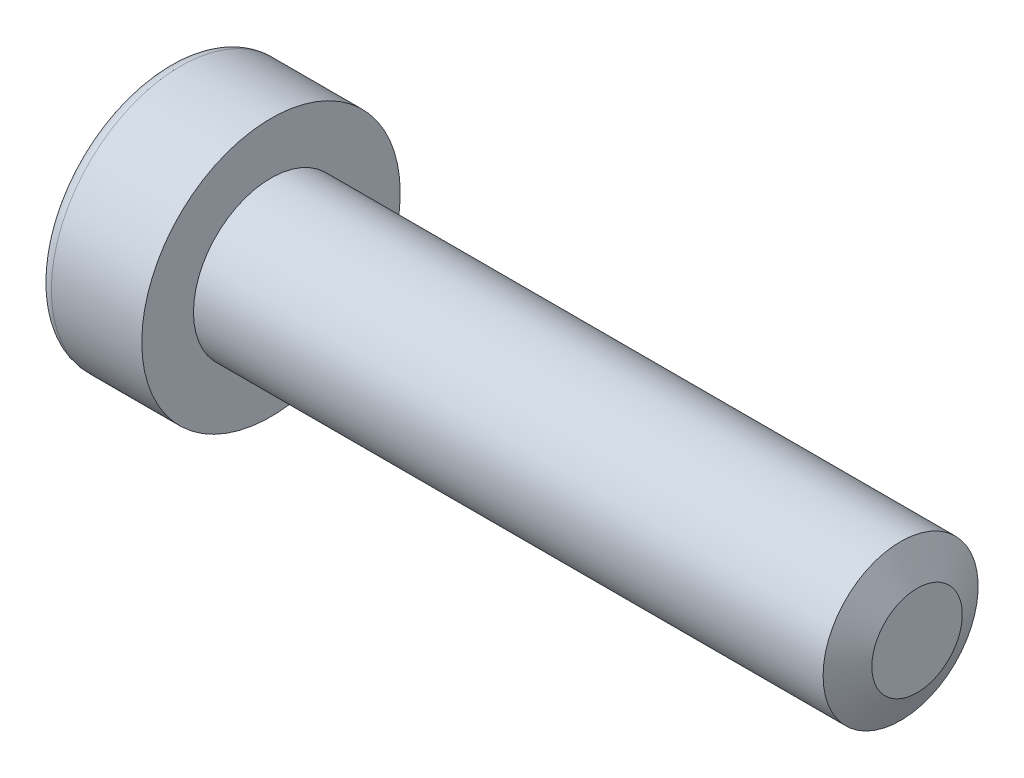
ISO-10303-21;
HEADER;
FILE_DESCRIPTION(('STEP AP214'),'2;1');
FILE_NAME('part.step','',(''),(''),'','','');
FILE_SCHEMA(('AUTOMOTIVE_DESIGN { 1 0 10303 214 1 1 1 1 }'));
ENDSEC;
DATA;
#1=APPLICATION_CONTEXT('core data for automotive mechanical design processes');
#2=APPLICATION_PROTOCOL_DEFINITION('international standard','automotive_design',2000,#1);
#3=PRODUCT_CONTEXT('',#1,'mechanical');
#4=PRODUCT('Part','Part','',(#3));
#5=PRODUCT_RELATED_PRODUCT_CATEGORY('part','',(#4));
#6=PRODUCT_DEFINITION_FORMATION('','',#4);
#7=PRODUCT_DEFINITION_CONTEXT('part definition',#1,'design');
#8=PRODUCT_DEFINITION('design','',#6,#7);
#9=PRODUCT_DEFINITION_SHAPE('','',#8);
#10=(LENGTH_UNIT() NAMED_UNIT(*) SI_UNIT(.MILLI.,.METRE.));
#11=(NAMED_UNIT(*) PLANE_ANGLE_UNIT() SI_UNIT($,.RADIAN.));
#12=(NAMED_UNIT(*) SI_UNIT($,.STERADIAN.) SOLID_ANGLE_UNIT());
#13=UNCERTAINTY_MEASURE_WITH_UNIT(LENGTH_MEASURE(1.E-05),#10,'distance_accuracy_value','');
#14=(GEOMETRIC_REPRESENTATION_CONTEXT(3) GLOBAL_UNCERTAINTY_ASSIGNED_CONTEXT((#13)) GLOBAL_UNIT_ASSIGNED_CONTEXT((#10,
#11,#12)) REPRESENTATION_CONTEXT('',''));
#15=CARTESIAN_POINT('',(0.,0.,0.));
#16=DIRECTION('',(0.,0.,1.));
#17=DIRECTION('',(1.,0.,0.));
#18=AXIS2_PLACEMENT_3D('',#15,#16,#17);
#19=CARTESIAN_POINT('',(-25.,5.,0.));
#20=DIRECTION('',(-1.,0.,0.));
#21=DIRECTION('',(0.,0.,1.));
#22=AXIS2_PLACEMENT_3D('',#19,#20,#21);
#23=PLANE('',#22);
#24=CARTESIAN_POINT('',(-25.,0.,0.));
#25=DIRECTION('',(-1.,0.,0.));
#26=DIRECTION('',(0.,0.,1.));
#27=AXIS2_PLACEMENT_3D('',#24,#25,#26);
#28=CIRCLE('',#27,5.);
#29=CARTESIAN_POINT('',(-25.,0.,5.));
#30=VERTEX_POINT('',#29);
#31=EDGE_CURVE('E147',#30,#30,#28,.T.);
#32=ORIENTED_EDGE('',*,*,#31,.F.);
#33=EDGE_LOOP('',(#32));
#34=FACE_BOUND('',#33,.T.);
#35=CARTESIAN_POINT('',(-25.,0.,0.));
#36=DIRECTION('',(-1.,0.,0.));
#37=DIRECTION('',(0.,0.,1.));
#38=AXIS2_PLACEMENT_3D('',#35,#36,#37);
#39=CIRCLE('',#38,3.);
#40=CARTESIAN_POINT('',(-25.,0.,3.));
#41=VERTEX_POINT('',#40);
#42=EDGE_CURVE('E139',#41,#41,#39,.T.);
#43=ORIENTED_EDGE('',*,*,#42,.T.);
#44=EDGE_LOOP('',(#43));
#45=FACE_BOUND('',#44,.T.);
#46=ADVANCED_FACE('F37',(#34,#45),#23,.F.);
#47=CARTESIAN_POINT('',(-65.0118083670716,0.,0.));
#48=DIRECTION('',(-1.,0.,0.));
#49=DIRECTION('',(0.,0.,1.));
#50=AXIS2_PLACEMENT_3D('',#47,#48,#49);
#51=CYLINDRICAL_SURFACE('',#50,5.);
#52=CARTESIAN_POINT('',(-28.5,0.,0.));
#53=DIRECTION('',(1.,0.,0.));
#54=DIRECTION('',(0.,0.,-1.));
#55=AXIS2_PLACEMENT_3D('',#52,#53,#54);
#56=CIRCLE('',#55,5.);
#57=CARTESIAN_POINT('',(-28.5,0.,-5.));
#58=VERTEX_POINT('',#57);
#59=EDGE_CURVE('E153',#58,#58,#56,.T.);
#60=ORIENTED_EDGE('',*,*,#59,.T.);
#61=EDGE_LOOP('',(#60));
#62=FACE_BOUND('',#61,.T.);
#63=ORIENTED_EDGE('',*,*,#31,.T.);
#64=EDGE_LOOP('',(#63));
#65=FACE_BOUND('',#64,.T.);
#66=ADVANCED_FACE('F170',(#62,#65),#51,.T.);
#67=CARTESIAN_POINT('',(-29.,0.,0.));
#68=DIRECTION('',(1.,0.,0.));
#69=DIRECTION('',(0.,0.,-1.));
#70=AXIS2_PLACEMENT_3D('',#67,#68,#69);
#71=PLANE('',#70);
#72=DIRECTION('',(0.,0.5,-0.866025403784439));
#73=VECTOR('',#72,1.);
#74=CARTESIAN_POINT('',(-29.,1.15470053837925,2.));
#75=LINE('',#74,#73);
#76=CARTESIAN_POINT('',(-29.,1.15470053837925,2.));
#77=VERTEX_POINT('',#76);
#78=CARTESIAN_POINT('',(-29.,2.3094010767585,0.));
#79=VERTEX_POINT('',#78);
#80=EDGE_CURVE('E126',#77,#79,#75,.T.);
#81=ORIENTED_EDGE('',*,*,#80,.F.);
#82=DIRECTION('',(0.,1.,0.));
#83=VECTOR('',#82,1.);
#84=CARTESIAN_POINT('',(-29.,-1.15470053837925,2.));
#85=LINE('',#84,#83);
#86=CARTESIAN_POINT('',(-29.,-1.15470053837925,2.));
#87=VERTEX_POINT('',#86);
#88=EDGE_CURVE('E52',#87,#77,#85,.T.);
#89=ORIENTED_EDGE('',*,*,#88,.F.);
#90=DIRECTION('',(0.,0.5,0.866025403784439));
#91=VECTOR('',#90,1.);
#92=CARTESIAN_POINT('',(-29.,-2.3094010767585,0.));
#93=LINE('',#92,#91);
#94=CARTESIAN_POINT('',(-29.,-2.3094010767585,0.));
#95=VERTEX_POINT('',#94);
#96=EDGE_CURVE('E135',#95,#87,#93,.T.);
#97=ORIENTED_EDGE('',*,*,#96,.F.);
#98=DIRECTION('',(0.,-0.5,0.866025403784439));
#99=VECTOR('',#98,1.);
#100=CARTESIAN_POINT('',(-29.,-1.15470053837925,-2.));
#101=LINE('',#100,#99);
#102=CARTESIAN_POINT('',(-29.,-1.15470053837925,-2.));
#103=VERTEX_POINT('',#102);
#104=EDGE_CURVE('E133',#103,#95,#101,.T.);
#105=ORIENTED_EDGE('',*,*,#104,.F.);
#106=DIRECTION('',(0.,-1.,0.));
#107=VECTOR('',#106,1.);
#108=CARTESIAN_POINT('',(-29.,1.15470053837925,-2.));
#109=LINE('',#108,#107);
#110=CARTESIAN_POINT('',(-29.,1.15470053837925,-2.));
#111=VERTEX_POINT('',#110);
#112=EDGE_CURVE('E100',#111,#103,#109,.T.);
#113=ORIENTED_EDGE('',*,*,#112,.F.);
#114=DIRECTION('',(0.,-0.5,-0.866025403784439));
#115=VECTOR('',#114,1.);
#116=CARTESIAN_POINT('',(-29.,2.3094010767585,0.));
#117=LINE('',#116,#115);
#118=EDGE_CURVE('E129',#79,#111,#117,.T.);
#119=ORIENTED_EDGE('',*,*,#118,.F.);
#120=EDGE_LOOP('',(#81,#89,#97,#105,#113,#119));
#121=FACE_BOUND('',#120,.T.);
#122=CARTESIAN_POINT('',(-29.,0.,0.));
#123=DIRECTION('',(1.,0.,0.));
#124=DIRECTION('',(0.,0.,-1.));
#125=AXIS2_PLACEMENT_3D('',#122,#123,#124);
#126=CIRCLE('',#125,4.5);
#127=CARTESIAN_POINT('',(-29.,0.,-4.5));
#128=VERTEX_POINT('',#127);
#129=EDGE_CURVE('E150',#128,#128,#126,.F.);
#130=ORIENTED_EDGE('',*,*,#129,.T.);
#131=EDGE_LOOP('',(#130));
#132=FACE_BOUND('',#131,.T.);
#133=ADVANCED_FACE('F176',(#121,#132),#71,.F.);
#134=CARTESIAN_POINT('',(0.,3.,0.));
#135=DIRECTION('',(-1.,0.,0.));
#136=DIRECTION('',(0.,0.,1.));
#137=AXIS2_PLACEMENT_3D('',#134,#135,#136);
#138=PLANE('',#137);
#139=CARTESIAN_POINT('',(0.,0.,0.));
#140=DIRECTION('',(-1.,0.,0.));
#141=DIRECTION('',(0.,0.,1.));
#142=AXIS2_PLACEMENT_3D('',#139,#140,#141);
#143=CIRCLE('',#142,1.74999999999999);
#144=CARTESIAN_POINT('',(0.,0.,1.74999999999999));
#145=VERTEX_POINT('',#144);
#146=EDGE_CURVE('E11',#145,#145,#143,.F.);
#147=ORIENTED_EDGE('',*,*,#146,.T.);
#148=EDGE_LOOP('',(#147));
#149=FACE_BOUND('',#148,.T.);
#150=ADVANCED_FACE('F192',(#149),#138,.F.);
#151=CARTESIAN_POINT('',(-65.0118083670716,0.,0.));
#152=DIRECTION('',(-1.,0.,0.));
#153=DIRECTION('',(0.,0.,1.));
#154=AXIS2_PLACEMENT_3D('',#151,#152,#153);
#155=CYLINDRICAL_SURFACE('',#154,3.);
#156=CARTESIAN_POINT('',(-0.636906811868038,0.,0.));
#157=DIRECTION('',(-1.,0.,0.));
#158=DIRECTION('',(0.,0.,1.));
#159=AXIS2_PLACEMENT_3D('',#156,#157,#158);
#160=CIRCLE('',#159,3.);
#161=CARTESIAN_POINT('',(-0.636906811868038,0.,3.));
#162=VERTEX_POINT('',#161);
#163=EDGE_CURVE('E45',#162,#162,#160,.T.);
#164=ORIENTED_EDGE('',*,*,#163,.T.);
#165=EDGE_LOOP('',(#164));
#166=FACE_BOUND('',#165,.T.);
#167=ORIENTED_EDGE('',*,*,#42,.F.);
#168=EDGE_LOOP('',(#167));
#169=FACE_BOUND('',#168,.T.);
#170=ADVANCED_FACE('F158',(#166,#169),#155,.T.);
#171=CARTESIAN_POINT('',(-28.5,0.,0.));
#172=DIRECTION('',(1.,0.,0.));
#173=DIRECTION('',(0.,0.,-1.));
#174=AXIS2_PLACEMENT_3D('',#171,#172,#173);
#175=TOROIDAL_SURFACE('',#174,4.5,0.5);
#176=ORIENTED_EDGE('',*,*,#59,.F.);
#177=EDGE_LOOP('',(#176));
#178=FACE_BOUND('',#177,.T.);
#179=ORIENTED_EDGE('',*,*,#129,.F.);
#180=EDGE_LOOP('',(#179));
#181=FACE_BOUND('',#180,.T.);
#182=ADVANCED_FACE('F182',(#178,#181),#175,.T.);
#183=CARTESIAN_POINT('',(-26.,-1.15470053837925,2.));
#184=DIRECTION('',(0.,0.,1.));
#185=DIRECTION('',(1.,0.,0.));
#186=AXIS2_PLACEMENT_3D('',#183,#184,#185);
#187=PLANE('',#186);
#188=ORIENTED_EDGE('',*,*,#88,.T.);
#189=DIRECTION('',(-1.,0.,0.));
#190=VECTOR('',#189,1.);
#191=CARTESIAN_POINT('',(-26.,1.15470053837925,2.));
#192=LINE('',#191,#190);
#193=CARTESIAN_POINT('',(-26.,1.15470053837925,2.));
#194=VERTEX_POINT('',#193);
#195=EDGE_CURVE('E82',#194,#77,#192,.T.);
#196=ORIENTED_EDGE('',*,*,#195,.F.);
#197=DIRECTION('',(0.,1.,0.));
#198=VECTOR('',#197,1.);
#199=CARTESIAN_POINT('',(-26.,-1.15470053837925,2.));
#200=LINE('',#199,#198);
#201=CARTESIAN_POINT('',(-26.,-1.15470053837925,2.));
#202=VERTEX_POINT('',#201);
#203=EDGE_CURVE('E137',#202,#194,#200,.T.);
#204=ORIENTED_EDGE('',*,*,#203,.F.);
#205=DIRECTION('',(-1.,0.,0.));
#206=VECTOR('',#205,1.);
#207=CARTESIAN_POINT('',(-26.,-1.15470053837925,2.));
#208=LINE('',#207,#206);
#209=EDGE_CURVE('E60',#202,#87,#208,.T.);
#210=ORIENTED_EDGE('',*,*,#209,.T.);
#211=EDGE_LOOP('',(#188,#196,#204,#210));
#212=FACE_BOUND('',#211,.T.);
#213=ADVANCED_FACE('F184',(#212),#187,.F.);
#214=CARTESIAN_POINT('',(-26.,-2.3094010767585,0.));
#215=DIRECTION('',(0.,-0.866025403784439,0.5));
#216=DIRECTION('',(0.,-0.5,-0.866025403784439));
#217=AXIS2_PLACEMENT_3D('',#214,#215,#216);
#218=PLANE('',#217);
#219=ORIENTED_EDGE('',*,*,#96,.T.);
#220=ORIENTED_EDGE('',*,*,#209,.F.);
#221=DIRECTION('',(0.,0.5,0.866025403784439));
#222=VECTOR('',#221,1.);
#223=CARTESIAN_POINT('',(-26.,-2.3094010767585,0.));
#224=LINE('',#223,#222);
#225=CARTESIAN_POINT('',(-26.,-2.3094010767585,0.));
#226=VERTEX_POINT('',#225);
#227=EDGE_CURVE('E112',#226,#202,#224,.T.);
#228=ORIENTED_EDGE('',*,*,#227,.F.);
#229=DIRECTION('',(-1.,0.,0.));
#230=VECTOR('',#229,1.);
#231=CARTESIAN_POINT('',(-26.,-2.3094010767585,0.));
#232=LINE('',#231,#230);
#233=EDGE_CURVE('E104',#226,#95,#232,.T.);
#234=ORIENTED_EDGE('',*,*,#233,.T.);
#235=EDGE_LOOP('',(#219,#220,#228,#234));
#236=FACE_BOUND('',#235,.T.);
#237=ADVANCED_FACE('F190',(#236),#218,.F.);
#238=CARTESIAN_POINT('',(-26.,-1.15470053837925,-2.));
#239=DIRECTION('',(0.,-0.866025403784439,-0.5));
#240=DIRECTION('',(0.,0.5,-0.866025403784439));
#241=AXIS2_PLACEMENT_3D('',#238,#239,#240);
#242=PLANE('',#241);
#243=ORIENTED_EDGE('',*,*,#104,.T.);
#244=ORIENTED_EDGE('',*,*,#233,.F.);
#245=DIRECTION('',(0.,-0.5,0.866025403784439));
#246=VECTOR('',#245,1.);
#247=CARTESIAN_POINT('',(-26.,-1.15470053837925,-2.));
#248=LINE('',#247,#246);
#249=CARTESIAN_POINT('',(-26.,-1.15470053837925,-2.));
#250=VERTEX_POINT('',#249);
#251=EDGE_CURVE('E108',#250,#226,#248,.T.);
#252=ORIENTED_EDGE('',*,*,#251,.F.);
#253=DIRECTION('',(-1.,0.,0.));
#254=VECTOR('',#253,1.);
#255=CARTESIAN_POINT('',(-26.,-1.15470053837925,-2.));
#256=LINE('',#255,#254);
#257=EDGE_CURVE('E93',#250,#103,#256,.T.);
#258=ORIENTED_EDGE('',*,*,#257,.T.);
#259=EDGE_LOOP('',(#243,#244,#252,#258));
#260=FACE_BOUND('',#259,.T.);
#261=ADVANCED_FACE('F109',(#260),#242,.F.);
#262=CARTESIAN_POINT('',(-26.,1.15470053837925,-2.));
#263=DIRECTION('',(0.,0.,-1.));
#264=DIRECTION('',(-1.,0.,0.));
#265=AXIS2_PLACEMENT_3D('',#262,#263,#264);
#266=PLANE('',#265);
#267=ORIENTED_EDGE('',*,*,#112,.T.);
#268=ORIENTED_EDGE('',*,*,#257,.F.);
#269=DIRECTION('',(0.,-1.,0.));
#270=VECTOR('',#269,1.);
#271=CARTESIAN_POINT('',(-26.,1.15470053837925,-2.));
#272=LINE('',#271,#270);
#273=CARTESIAN_POINT('',(-26.,1.15470053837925,-2.));
#274=VERTEX_POINT('',#273);
#275=EDGE_CURVE('E97',#274,#250,#272,.T.);
#276=ORIENTED_EDGE('',*,*,#275,.F.);
#277=DIRECTION('',(-1.,0.,0.));
#278=VECTOR('',#277,1.);
#279=CARTESIAN_POINT('',(-26.,1.15470053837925,-2.));
#280=LINE('',#279,#278);
#281=EDGE_CURVE('E105',#274,#111,#280,.T.);
#282=ORIENTED_EDGE('',*,*,#281,.T.);
#283=EDGE_LOOP('',(#267,#268,#276,#282));
#284=FACE_BOUND('',#283,.T.);
#285=ADVANCED_FACE('F95',(#284),#266,.F.);
#286=CARTESIAN_POINT('',(-26.,2.3094010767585,0.));
#287=DIRECTION('',(0.,0.866025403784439,-0.5));
#288=DIRECTION('',(0.,0.5,0.866025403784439));
#289=AXIS2_PLACEMENT_3D('',#286,#287,#288);
#290=PLANE('',#289);
#291=ORIENTED_EDGE('',*,*,#118,.T.);
#292=ORIENTED_EDGE('',*,*,#281,.F.);
#293=DIRECTION('',(0.,-0.5,-0.866025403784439));
#294=VECTOR('',#293,1.);
#295=CARTESIAN_POINT('',(-26.,2.3094010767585,0.));
#296=LINE('',#295,#294);
#297=CARTESIAN_POINT('',(-26.,2.3094010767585,0.));
#298=VERTEX_POINT('',#297);
#299=EDGE_CURVE('E118',#298,#274,#296,.T.);
#300=ORIENTED_EDGE('',*,*,#299,.F.);
#301=DIRECTION('',(-1.,0.,0.));
#302=VECTOR('',#301,1.);
#303=CARTESIAN_POINT('',(-26.,2.3094010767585,0.));
#304=LINE('',#303,#302);
#305=EDGE_CURVE('E142',#298,#79,#304,.T.);
#306=ORIENTED_EDGE('',*,*,#305,.T.);
#307=EDGE_LOOP('',(#291,#292,#300,#306));
#308=FACE_BOUND('',#307,.T.);
#309=ADVANCED_FACE('F209',(#308),#290,.F.);
#310=CARTESIAN_POINT('',(-26.,1.15470053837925,2.));
#311=DIRECTION('',(0.,0.866025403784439,0.5));
#312=DIRECTION('',(0.,-0.5,0.866025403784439));
#313=AXIS2_PLACEMENT_3D('',#310,#311,#312);
#314=PLANE('',#313);
#315=ORIENTED_EDGE('',*,*,#80,.T.);
#316=ORIENTED_EDGE('',*,*,#305,.F.);
#317=DIRECTION('',(0.,0.5,-0.866025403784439));
#318=VECTOR('',#317,1.);
#319=CARTESIAN_POINT('',(-26.,1.15470053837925,2.));
#320=LINE('',#319,#318);
#321=EDGE_CURVE('E120',#194,#298,#320,.T.);
#322=ORIENTED_EDGE('',*,*,#321,.F.);
#323=ORIENTED_EDGE('',*,*,#195,.T.);
#324=EDGE_LOOP('',(#315,#316,#322,#323));
#325=FACE_BOUND('',#324,.T.);
#326=ADVANCED_FACE('F166',(#325),#314,.F.);
#327=CARTESIAN_POINT('',(-26.,0.,0.));
#328=DIRECTION('',(-1.,0.,0.));
#329=DIRECTION('',(0.,0.,1.));
#330=AXIS2_PLACEMENT_3D('',#327,#328,#329);
#331=PLANE('',#330);
#332=ORIENTED_EDGE('',*,*,#203,.T.);
#333=ORIENTED_EDGE('',*,*,#321,.T.);
#334=ORIENTED_EDGE('',*,*,#299,.T.);
#335=ORIENTED_EDGE('',*,*,#275,.T.);
#336=ORIENTED_EDGE('',*,*,#251,.T.);
#337=ORIENTED_EDGE('',*,*,#227,.T.);
#338=EDGE_LOOP('',(#332,#333,#334,#335,#336,#337));
#339=FACE_BOUND('',#338,.T.);
#340=ADVANCED_FACE('F115',(#339),#331,.T.);
#341=CARTESIAN_POINT('',(-0.636906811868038,0.,0.));
#342=DIRECTION('',(-1.,0.,0.));
#343=DIRECTION('',(0.,0.,1.));
#344=AXIS2_PLACEMENT_3D('',#341,#342,#343);
#345=CONICAL_SURFACE('',#344,3.,1.09955742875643);
#346=CARTESIAN_POINT('',(0.,0.,1.74999999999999));
#347=CARTESIAN_POINT('',(-0.00663444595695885,0.,1.76302083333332));
#348=CARTESIAN_POINT('',(-0.0132688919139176,0.,1.77604166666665));
#349=CARTESIAN_POINT('',(-0.026537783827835,0.,1.80208333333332));
#350=CARTESIAN_POINT('',(-0.0331722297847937,0.,1.81510416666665));
#351=CARTESIAN_POINT('',(-0.0464411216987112,0.,1.84114583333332));
#352=CARTESIAN_POINT('',(-0.0530755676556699,0.,1.85416666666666));
#353=CARTESIAN_POINT('',(-0.0663444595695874,0.,1.88020833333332));
#354=CARTESIAN_POINT('',(-0.0729789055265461,0.,1.89322916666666));
#355=CARTESIAN_POINT('',(-0.0862477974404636,0.,1.91927083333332));
#356=CARTESIAN_POINT('',(-0.0928822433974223,0.,1.93229166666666));
#357=CARTESIAN_POINT('',(-0.10615113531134,0.,1.95833333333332));
#358=CARTESIAN_POINT('',(-0.112785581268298,0.,1.97135416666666));
#359=CARTESIAN_POINT('',(-0.126054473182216,0.,1.99739583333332));
#360=CARTESIAN_POINT('',(-0.132688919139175,0.,2.01041666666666));
#361=CARTESIAN_POINT('',(-0.145957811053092,0.,2.03645833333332));
#362=CARTESIAN_POINT('',(-0.152592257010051,0.,2.04947916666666));
#363=CARTESIAN_POINT('',(-0.165861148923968,0.,2.07552083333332));
#364=CARTESIAN_POINT('',(-0.172495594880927,0.,2.08854166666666));
#365=CARTESIAN_POINT('',(-0.185764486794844,0.,2.11458333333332));
#366=CARTESIAN_POINT('',(-0.192398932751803,0.,2.12760416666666));
#367=CARTESIAN_POINT('',(-0.205667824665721,0.,2.15364583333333));
#368=CARTESIAN_POINT('',(-0.212302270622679,0.,2.16666666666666));
#369=CARTESIAN_POINT('',(-0.225571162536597,0.,2.19270833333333));
#370=CARTESIAN_POINT('',(-0.232205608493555,0.,2.20572916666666));
#371=CARTESIAN_POINT('',(-0.245474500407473,0.,2.23177083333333));
#372=CARTESIAN_POINT('',(-0.252108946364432,0.,2.24479166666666));
#373=CARTESIAN_POINT('',(-0.265377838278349,0.,2.27083333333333));
#374=CARTESIAN_POINT('',(-0.272012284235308,0.,2.28385416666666));
#375=CARTESIAN_POINT('',(-0.285281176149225,0.,2.30989583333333));
#376=CARTESIAN_POINT('',(-0.291915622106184,0.,2.32291666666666));
#377=CARTESIAN_POINT('',(-0.305184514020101,0.,2.34895833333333));
#378=CARTESIAN_POINT('',(-0.31181895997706,0.,2.36197916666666));
#379=CARTESIAN_POINT('',(-0.325087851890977,0.,2.38802083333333));
#380=CARTESIAN_POINT('',(-0.331722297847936,0.,2.40104166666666));
#381=CARTESIAN_POINT('',(-0.344991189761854,0.,2.42708333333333));
#382=CARTESIAN_POINT('',(-0.351625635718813,0.,2.44010416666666));
#383=CARTESIAN_POINT('',(-0.36489452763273,0.,2.46614583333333));
#384=CARTESIAN_POINT('',(-0.371528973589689,0.,2.47916666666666));
#385=CARTESIAN_POINT('',(-0.384797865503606,0.,2.50520833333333));
#386=CARTESIAN_POINT('',(-0.391432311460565,0.,2.51822916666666));
#387=CARTESIAN_POINT('',(-0.404701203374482,0.,2.54427083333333));
#388=CARTESIAN_POINT('',(-0.411335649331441,0.,2.55729166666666));
#389=CARTESIAN_POINT('',(-0.424604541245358,0.,2.58333333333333));
#390=CARTESIAN_POINT('',(-0.431238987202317,0.,2.59635416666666));
#391=CARTESIAN_POINT('',(-0.444507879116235,0.,2.62239583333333));
#392=CARTESIAN_POINT('',(-0.451142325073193,0.,2.63541666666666));
#393=CARTESIAN_POINT('',(-0.464411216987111,0.,2.66145833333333));
#394=CARTESIAN_POINT('',(-0.471045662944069,0.,2.67447916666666));
#395=CARTESIAN_POINT('',(-0.484314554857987,0.,2.70052083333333));
#396=CARTESIAN_POINT('',(-0.490949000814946,0.,2.71354166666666));
#397=CARTESIAN_POINT('',(-0.504217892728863,0.,2.73958333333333));
#398=CARTESIAN_POINT('',(-0.510852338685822,0.,2.75260416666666));
#399=CARTESIAN_POINT('',(-0.524121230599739,0.,2.77864583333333));
#400=CARTESIAN_POINT('',(-0.530755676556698,0.,2.79166666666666));
#401=CARTESIAN_POINT('',(-0.544024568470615,0.,2.81770833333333));
#402=CARTESIAN_POINT('',(-0.550659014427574,0.,2.83072916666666));
#403=CARTESIAN_POINT('',(-0.563927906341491,0.,2.85677083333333));
#404=CARTESIAN_POINT('',(-0.57056235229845,0.,2.86979166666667));
#405=CARTESIAN_POINT('',(-0.583831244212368,0.,2.89583333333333));
#406=CARTESIAN_POINT('',(-0.590465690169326,0.,2.90885416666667));
#407=CARTESIAN_POINT('',(-0.603734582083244,0.,2.93489583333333));
#408=CARTESIAN_POINT('',(-0.610369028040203,0.,2.94791666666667));
#409=CARTESIAN_POINT('',(-0.62363791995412,0.,2.97395833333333));
#410=CARTESIAN_POINT('',(-0.630272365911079,0.,2.98697916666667));
#411=CARTESIAN_POINT('',(-0.636906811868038,0.,3.));
#412=B_SPLINE_CURVE_WITH_KNOTS('',3,(#346,#347,#348,#349,#350,#351,#352,#353,#354,#355,#356,
#357,#358,#359,#360,#361,#362,#363,#364,#365,#366,#367,#368,#369,#370,#371,#372,#373,#374,#375,
#376,#377,#378,#379,#380,#381,#382,#383,#384,#385,#386,#387,#388,#389,#390,#391,#392,#393,#394,
#395,#396,#397,#398,#399,#400,#401,#402,#403,#404,#405,#406,#407,#408,#409,#410,#411),
.UNSPECIFIED.,.F.,.F.,(4,2,2,2,2,2,2,2,2,2,2,2,2,2,2,2,2,2,2,2,2,2,2,2,2,2,2,2,2,2,2,2,4),(0.,
0.0438408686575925,0.0876817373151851,0.131522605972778,0.17536347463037,0.219204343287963,
0.263045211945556,0.306886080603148,0.35072694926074,0.394567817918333,0.438408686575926,
0.482249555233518,0.526090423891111,0.569931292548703,0.613772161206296,0.657613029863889,
0.701453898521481,0.745294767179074,0.789135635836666,0.832976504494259,0.876817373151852,
0.920658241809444,0.964499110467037,1.00833997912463,1.05218084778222,1.09602171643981,
1.13986258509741,1.183703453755,1.22754432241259,1.27138519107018,1.31522605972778,
1.35906692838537,1.40290779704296),.UNSPECIFIED.);
#413=EDGE_CURVE('BSEAM39',#145,#162,#412,.T.);
#414=ORIENTED_EDGE('',*,*,#146,.F.);
#415=ORIENTED_EDGE('',*,*,#163,.F.);
#416=ORIENTED_EDGE('',*,*,#413,.T.);
#417=ORIENTED_EDGE('',*,*,#413,.F.);
#418=EDGE_LOOP('',(#414,#416,#415,#417));
#419=FACE_BOUND('',#418,.T.);
#420=ADVANCED_FACE('F39',(#419),#345,.T.);
#421=CLOSED_SHELL('',(#46,#66,#133,#150,#170,#182,#213,#237,#261,#285,#309,#326,#340,#420));
#422=MANIFOLD_SOLID_BREP('B2',#421);
#423=ADVANCED_BREP_SHAPE_REPRESENTATION('',(#18,#422),#14);
#424=SHAPE_DEFINITION_REPRESENTATION(#9,#423);
ENDSEC;
END-ISO-10303-21;
